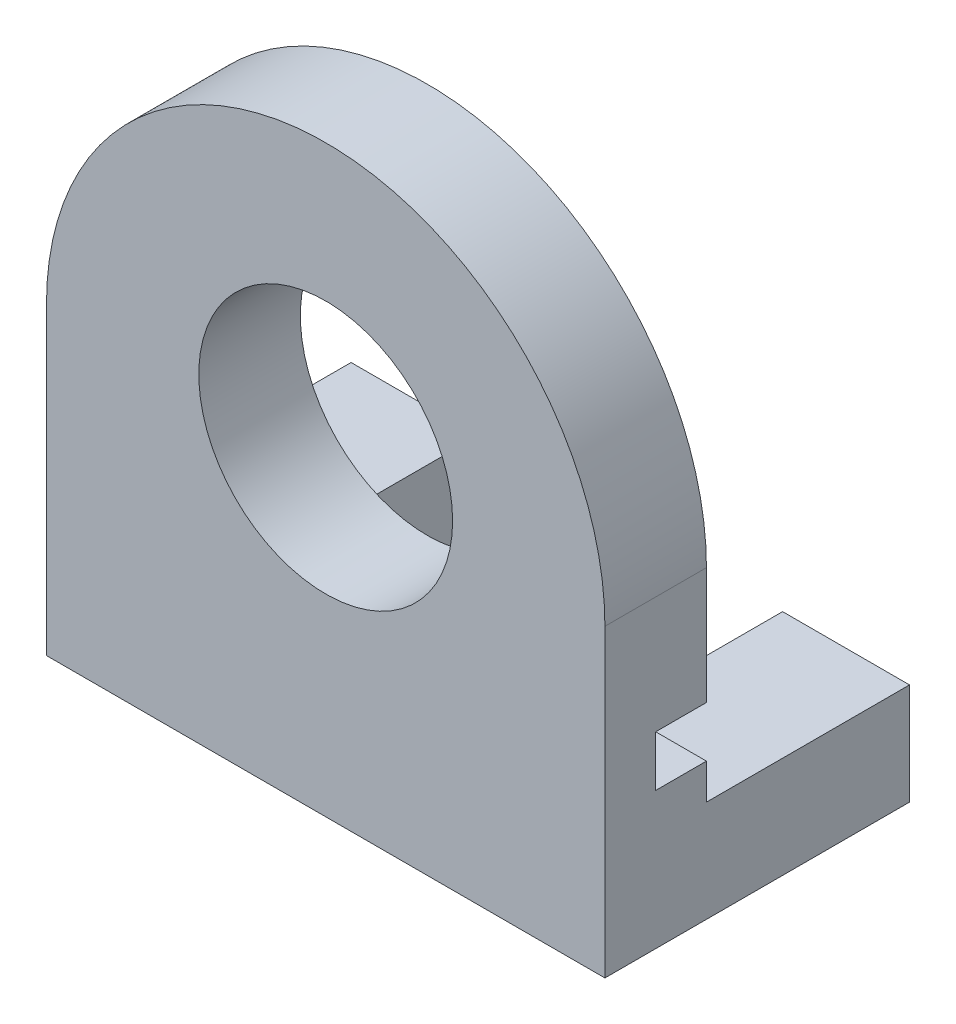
ISO-10303-21;
HEADER;
FILE_DESCRIPTION(('STEP AP214'),'2;1');
FILE_NAME('part.step','',(''),(''),'','','');
FILE_SCHEMA(('AUTOMOTIVE_DESIGN { 1 0 10303 214 1 1 1 1 }'));
ENDSEC;
DATA;
#1=APPLICATION_CONTEXT('core data for automotive mechanical design processes');
#2=APPLICATION_PROTOCOL_DEFINITION('international standard','automotive_design',2000,#1);
#3=PRODUCT_CONTEXT('',#1,'mechanical');
#4=PRODUCT('Part','Part','',(#3));
#5=PRODUCT_RELATED_PRODUCT_CATEGORY('part','',(#4));
#6=PRODUCT_DEFINITION_FORMATION('','',#4);
#7=PRODUCT_DEFINITION_CONTEXT('part definition',#1,'design');
#8=PRODUCT_DEFINITION('design','',#6,#7);
#9=PRODUCT_DEFINITION_SHAPE('','',#8);
#10=(LENGTH_UNIT() NAMED_UNIT(*) SI_UNIT(.MILLI.,.METRE.));
#11=(NAMED_UNIT(*) PLANE_ANGLE_UNIT() SI_UNIT($,.RADIAN.));
#12=(NAMED_UNIT(*) SI_UNIT($,.STERADIAN.) SOLID_ANGLE_UNIT());
#13=UNCERTAINTY_MEASURE_WITH_UNIT(LENGTH_MEASURE(1.E-05),#10,'distance_accuracy_value','');
#14=(GEOMETRIC_REPRESENTATION_CONTEXT(3) GLOBAL_UNCERTAINTY_ASSIGNED_CONTEXT((#13)) GLOBAL_UNIT_ASSIGNED_CONTEXT((#10,
#11,#12)) REPRESENTATION_CONTEXT('',''));
#15=CARTESIAN_POINT('',(0.,0.,0.));
#16=DIRECTION('',(0.,0.,1.));
#17=DIRECTION('',(1.,0.,0.));
#18=AXIS2_PLACEMENT_3D('',#15,#16,#17);
#19=CARTESIAN_POINT('',(5.5,6.,-2.));
#20=DIRECTION('',(0.,0.,1.));
#21=DIRECTION('',(1.,0.,0.));
#22=AXIS2_PLACEMENT_3D('',#19,#20,#21);
#23=PLANE('',#22);
#24=CARTESIAN_POINT('',(5.5,6.3,-2.));
#25=DIRECTION('',(0.,0.,1.));
#26=DIRECTION('',(1.,0.,0.));
#27=AXIS2_PLACEMENT_3D('',#24,#25,#26);
#28=CIRCLE('',#27,2.5);
#29=CARTESIAN_POINT('',(8.,6.3,-2.));
#30=VERTEX_POINT('',#29);
#31=EDGE_CURVE('E254',#30,#30,#28,.T.);
#32=ORIENTED_EDGE('',*,*,#31,.T.);
#33=EDGE_LOOP('',(#32));
#34=FACE_BOUND('',#33,.T.);
#35=DIRECTION('',(0.,1.,0.));
#36=VECTOR('',#35,1.);
#37=CARTESIAN_POINT('',(11.,0.,-2.));
#38=LINE('',#37,#36);
#39=CARTESIAN_POINT('',(11.,3.7,-2.));
#40=VERTEX_POINT('',#39);
#41=CARTESIAN_POINT('',(11.,6.,-2.));
#42=VERTEX_POINT('',#41);
#43=EDGE_CURVE('E180',#40,#42,#38,.T.);
#44=ORIENTED_EDGE('',*,*,#43,.F.);
#45=DIRECTION('',(-1.,0.,0.));
#46=VECTOR('',#45,1.);
#47=CARTESIAN_POINT('',(11.5,3.7,-2.));
#48=LINE('',#47,#46);
#49=CARTESIAN_POINT('',(0.,3.7,-2.));
#50=VERTEX_POINT('',#49);
#51=EDGE_CURVE('E315',#40,#50,#48,.T.);
#52=ORIENTED_EDGE('',*,*,#51,.T.);
#53=DIRECTION('',(0.,-1.,0.));
#54=VECTOR('',#53,1.);
#55=CARTESIAN_POINT('',(0.,0.,-2.));
#56=LINE('',#55,#54);
#57=CARTESIAN_POINT('',(0.,6.,-2.));
#58=VERTEX_POINT('',#57);
#59=EDGE_CURVE('E156',#58,#50,#56,.T.);
#60=ORIENTED_EDGE('',*,*,#59,.F.);
#61=CARTESIAN_POINT('',(5.5,6.,-2.));
#62=DIRECTION('',(0.,0.,1.));
#63=DIRECTION('',(1.,0.,0.));
#64=AXIS2_PLACEMENT_3D('',#61,#62,#63);
#65=CIRCLE('',#64,5.5);
#66=EDGE_CURVE('E240',#42,#58,#65,.T.);
#67=ORIENTED_EDGE('',*,*,#66,.F.);
#68=EDGE_LOOP('',(#44,#52,#60,#67));
#69=FACE_BOUND('',#68,.T.);
#70=ADVANCED_FACE('F32',(#34,#69),#23,.F.);
#71=CARTESIAN_POINT('',(0.,2.7,-2.));
#72=VERTEX_POINT('',#71);
#73=CARTESIAN_POINT('',(0.,2.,-2.));
#74=VERTEX_POINT('',#73);
#75=EDGE_CURVE('E36',#72,#74,#56,.T.);
#76=ORIENTED_EDGE('',*,*,#75,.F.);
#77=DIRECTION('',(-1.,0.,0.));
#78=VECTOR('',#77,1.);
#79=CARTESIAN_POINT('',(11.5,2.7,-2.));
#80=LINE('',#79,#78);
#81=CARTESIAN_POINT('',(11.,2.7,-2.));
#82=VERTEX_POINT('',#81);
#83=EDGE_CURVE('E133',#82,#72,#80,.T.);
#84=ORIENTED_EDGE('',*,*,#83,.F.);
#85=CARTESIAN_POINT('',(11.,2.,-2.));
#86=VERTEX_POINT('',#85);
#87=EDGE_CURVE('E241',#86,#82,#38,.T.);
#88=ORIENTED_EDGE('',*,*,#87,.F.);
#89=DIRECTION('',(1.,0.,0.));
#90=VECTOR('',#89,1.);
#91=CARTESIAN_POINT('',(11.,2.,-2.));
#92=LINE('',#91,#90);
#93=CARTESIAN_POINT('',(8.5,2.,-2.));
#94=VERTEX_POINT('',#93);
#95=EDGE_CURVE('E247',#94,#86,#92,.T.);
#96=ORIENTED_EDGE('',*,*,#95,.F.);
#97=DIRECTION('',(0.,1.,0.));
#98=VECTOR('',#97,1.);
#99=CARTESIAN_POINT('',(8.5,2.,-2.));
#100=LINE('',#99,#98);
#101=CARTESIAN_POINT('',(8.5,0.,-2.));
#102=VERTEX_POINT('',#101);
#103=EDGE_CURVE('E248',#102,#94,#100,.T.);
#104=ORIENTED_EDGE('',*,*,#103,.F.);
#105=DIRECTION('',(1.,0.,0.));
#106=VECTOR('',#105,1.);
#107=CARTESIAN_POINT('',(0.,0.,-2.));
#108=LINE('',#107,#106);
#109=CARTESIAN_POINT('',(2.5,0.,-2.));
#110=VERTEX_POINT('',#109);
#111=EDGE_CURVE('E57',#110,#102,#108,.T.);
#112=ORIENTED_EDGE('',*,*,#111,.F.);
#113=DIRECTION('',(0.,-1.,0.));
#114=VECTOR('',#113,1.);
#115=CARTESIAN_POINT('',(2.5,2.,-2.));
#116=LINE('',#115,#114);
#117=CARTESIAN_POINT('',(2.5,2.,-2.));
#118=VERTEX_POINT('',#117);
#119=EDGE_CURVE('E182',#118,#110,#116,.T.);
#120=ORIENTED_EDGE('',*,*,#119,.F.);
#121=DIRECTION('',(1.,0.,0.));
#122=VECTOR('',#121,1.);
#123=CARTESIAN_POINT('',(0.,2.,-2.));
#124=LINE('',#123,#122);
#125=EDGE_CURVE('E154',#74,#118,#124,.T.);
#126=ORIENTED_EDGE('',*,*,#125,.F.);
#127=EDGE_LOOP('',(#76,#84,#88,#96,#104,#112,#120,#126));
#128=FACE_BOUND('',#127,.T.);
#129=ADVANCED_FACE('F152',(#128),#23,.F.);
#130=CARTESIAN_POINT('',(0.,0.,-2.));
#131=DIRECTION('',(-1.,0.,0.));
#132=DIRECTION('',(0.,0.,1.));
#133=AXIS2_PLACEMENT_3D('',#130,#131,#132);
#134=PLANE('',#133);
#135=DIRECTION('',(0.,0.,-1.));
#136=VECTOR('',#135,1.);
#137=CARTESIAN_POINT('',(0.,3.7,-1.));
#138=LINE('',#137,#136);
#139=CARTESIAN_POINT('',(0.,3.7,-1.));
#140=VERTEX_POINT('',#139);
#141=EDGE_CURVE('E143',#140,#50,#138,.T.);
#142=ORIENTED_EDGE('',*,*,#141,.F.);
#143=DIRECTION('',(0.,1.,0.));
#144=VECTOR('',#143,1.);
#145=CARTESIAN_POINT('',(0.,2.7,-1.));
#146=LINE('',#145,#144);
#147=CARTESIAN_POINT('',(0.,2.7,-1.));
#148=VERTEX_POINT('',#147);
#149=EDGE_CURVE('E150',#148,#140,#146,.T.);
#150=ORIENTED_EDGE('',*,*,#149,.F.);
#151=DIRECTION('',(0.,0.,1.));
#152=VECTOR('',#151,1.);
#153=CARTESIAN_POINT('',(0.,2.7,-2.));
#154=LINE('',#153,#152);
#155=EDGE_CURVE('E136',#72,#148,#154,.T.);
#156=ORIENTED_EDGE('',*,*,#155,.F.);
#157=ORIENTED_EDGE('',*,*,#75,.T.);
#158=DIRECTION('',(0.,0.,1.));
#159=VECTOR('',#158,1.);
#160=CARTESIAN_POINT('',(0.,2.,-6.));
#161=LINE('',#160,#159);
#162=CARTESIAN_POINT('',(0.,2.,-6.));
#163=VERTEX_POINT('',#162);
#164=EDGE_CURVE('E186',#163,#74,#161,.T.);
#165=ORIENTED_EDGE('',*,*,#164,.F.);
#166=DIRECTION('',(0.,1.,0.));
#167=VECTOR('',#166,1.);
#168=CARTESIAN_POINT('',(0.,0.,-6.));
#169=LINE('',#168,#167);
#170=CARTESIAN_POINT('',(0.,0.,-6.));
#171=VERTEX_POINT('',#170);
#172=EDGE_CURVE('E203',#171,#163,#169,.T.);
#173=ORIENTED_EDGE('',*,*,#172,.F.);
#174=DIRECTION('',(0.,0.,1.));
#175=VECTOR('',#174,1.);
#176=CARTESIAN_POINT('',(0.,0.,-2.));
#177=LINE('',#176,#175);
#178=CARTESIAN_POINT('',(0.,0.,0.));
#179=VERTEX_POINT('',#178);
#180=EDGE_CURVE('E177',#171,#179,#177,.T.);
#181=ORIENTED_EDGE('',*,*,#180,.T.);
#182=DIRECTION('',(0.,-1.,0.));
#183=VECTOR('',#182,1.);
#184=CARTESIAN_POINT('',(0.,0.,0.));
#185=LINE('',#184,#183);
#186=CARTESIAN_POINT('',(0.,6.,0.));
#187=VERTEX_POINT('',#186);
#188=EDGE_CURVE('E188',#187,#179,#185,.T.);
#189=ORIENTED_EDGE('',*,*,#188,.F.);
#190=DIRECTION('',(0.,0.,1.));
#191=VECTOR('',#190,1.);
#192=CARTESIAN_POINT('',(0.,6.,-2.));
#193=LINE('',#192,#191);
#194=EDGE_CURVE('E236',#58,#187,#193,.T.);
#195=ORIENTED_EDGE('',*,*,#194,.F.);
#196=ORIENTED_EDGE('',*,*,#59,.T.);
#197=EDGE_LOOP('',(#142,#150,#156,#157,#165,#173,#181,#189,#195,#196));
#198=FACE_BOUND('',#197,.T.);
#199=ADVANCED_FACE('F34',(#198),#134,.T.);
#200=CARTESIAN_POINT('',(5.5,6.,-2.));
#201=DIRECTION('',(0.,0.,1.));
#202=DIRECTION('',(1.,0.,0.));
#203=AXIS2_PLACEMENT_3D('',#200,#201,#202);
#204=CYLINDRICAL_SURFACE('',#203,5.5);
#205=CARTESIAN_POINT('',(5.5,6.,0.));
#206=DIRECTION('',(0.,0.,1.));
#207=DIRECTION('',(1.,0.,0.));
#208=AXIS2_PLACEMENT_3D('',#205,#206,#207);
#209=CIRCLE('',#208,5.5);
#210=CARTESIAN_POINT('',(11.,6.,0.));
#211=VERTEX_POINT('',#210);
#212=EDGE_CURVE('E157',#211,#187,#209,.T.);
#213=ORIENTED_EDGE('',*,*,#212,.F.);
#214=DIRECTION('',(0.,0.,1.));
#215=VECTOR('',#214,1.);
#216=CARTESIAN_POINT('',(11.,6.,-2.));
#217=LINE('',#216,#215);
#218=EDGE_CURVE('E228',#42,#211,#217,.T.);
#219=ORIENTED_EDGE('',*,*,#218,.F.);
#220=ORIENTED_EDGE('',*,*,#66,.T.);
#221=ORIENTED_EDGE('',*,*,#194,.T.);
#222=EDGE_LOOP('',(#213,#219,#220,#221));
#223=FACE_BOUND('',#222,.T.);
#224=ADVANCED_FACE('F299',(#223),#204,.T.);
#225=CARTESIAN_POINT('',(11.,0.,-2.));
#226=DIRECTION('',(1.,0.,0.));
#227=DIRECTION('',(0.,0.,-1.));
#228=AXIS2_PLACEMENT_3D('',#225,#226,#227);
#229=PLANE('',#228);
#230=DIRECTION('',(0.,0.,1.));
#231=VECTOR('',#230,1.);
#232=CARTESIAN_POINT('',(11.,3.7,-2.));
#233=LINE('',#232,#231);
#234=CARTESIAN_POINT('',(11.,3.7,-1.));
#235=VERTEX_POINT('',#234);
#236=EDGE_CURVE('E11',#40,#235,#233,.T.);
#237=ORIENTED_EDGE('',*,*,#236,.F.);
#238=ORIENTED_EDGE('',*,*,#43,.T.);
#239=ORIENTED_EDGE('',*,*,#218,.T.);
#240=DIRECTION('',(0.,1.,0.));
#241=VECTOR('',#240,1.);
#242=CARTESIAN_POINT('',(11.,0.,0.));
#243=LINE('',#242,#241);
#244=CARTESIAN_POINT('',(11.,0.,0.));
#245=VERTEX_POINT('',#244);
#246=EDGE_CURVE('E161',#245,#211,#243,.T.);
#247=ORIENTED_EDGE('',*,*,#246,.F.);
#248=DIRECTION('',(0.,0.,1.));
#249=VECTOR('',#248,1.);
#250=CARTESIAN_POINT('',(11.,0.,-2.));
#251=LINE('',#250,#249);
#252=CARTESIAN_POINT('',(11.,0.,-6.));
#253=VERTEX_POINT('',#252);
#254=EDGE_CURVE('E221',#253,#245,#251,.T.);
#255=ORIENTED_EDGE('',*,*,#254,.F.);
#256=DIRECTION('',(0.,-1.,0.));
#257=VECTOR('',#256,1.);
#258=CARTESIAN_POINT('',(11.,0.,-6.));
#259=LINE('',#258,#257);
#260=CARTESIAN_POINT('',(11.,2.,-6.));
#261=VERTEX_POINT('',#260);
#262=EDGE_CURVE('E261',#261,#253,#259,.T.);
#263=ORIENTED_EDGE('',*,*,#262,.F.);
#264=DIRECTION('',(0.,0.,1.));
#265=VECTOR('',#264,1.);
#266=CARTESIAN_POINT('',(11.,2.,-6.));
#267=LINE('',#266,#265);
#268=EDGE_CURVE('E245',#261,#86,#267,.T.);
#269=ORIENTED_EDGE('',*,*,#268,.T.);
#270=ORIENTED_EDGE('',*,*,#87,.T.);
#271=DIRECTION('',(0.,0.,-1.));
#272=VECTOR('',#271,1.);
#273=CARTESIAN_POINT('',(11.,2.7,-2.));
#274=LINE('',#273,#272);
#275=CARTESIAN_POINT('',(11.,2.7,-1.));
#276=VERTEX_POINT('',#275);
#277=EDGE_CURVE('E139',#276,#82,#274,.T.);
#278=ORIENTED_EDGE('',*,*,#277,.F.);
#279=DIRECTION('',(0.,-1.,0.));
#280=VECTOR('',#279,1.);
#281=CARTESIAN_POINT('',(11.,0.,-1.));
#282=LINE('',#281,#280);
#283=EDGE_CURVE('E42',#235,#276,#282,.T.);
#284=ORIENTED_EDGE('',*,*,#283,.F.);
#285=EDGE_LOOP('',(#237,#238,#239,#247,#255,#263,#269,#270,#278,#284));
#286=FACE_BOUND('',#285,.T.);
#287=ADVANCED_FACE('F230',(#286),#229,.T.);
#288=CARTESIAN_POINT('',(0.,0.,-2.));
#289=DIRECTION('',(0.,-1.,0.));
#290=DIRECTION('',(0.,0.,-1.));
#291=AXIS2_PLACEMENT_3D('',#288,#289,#290);
#292=PLANE('',#291);
#293=DIRECTION('',(1.,0.,0.));
#294=VECTOR('',#293,1.);
#295=CARTESIAN_POINT('',(0.,0.,0.));
#296=LINE('',#295,#294);
#297=EDGE_CURVE('E167',#179,#245,#296,.T.);
#298=ORIENTED_EDGE('',*,*,#297,.F.);
#299=ORIENTED_EDGE('',*,*,#180,.F.);
#300=DIRECTION('',(-1.,0.,0.));
#301=VECTOR('',#300,1.);
#302=CARTESIAN_POINT('',(2.5,0.,-6.));
#303=LINE('',#302,#301);
#304=CARTESIAN_POINT('',(2.5,0.,-6.));
#305=VERTEX_POINT('',#304);
#306=EDGE_CURVE('E194',#305,#171,#303,.T.);
#307=ORIENTED_EDGE('',*,*,#306,.F.);
#308=DIRECTION('',(0.,0.,1.));
#309=VECTOR('',#308,1.);
#310=CARTESIAN_POINT('',(2.5,0.,-6.));
#311=LINE('',#310,#309);
#312=EDGE_CURVE('E195',#305,#110,#311,.T.);
#313=ORIENTED_EDGE('',*,*,#312,.T.);
#314=ORIENTED_EDGE('',*,*,#111,.T.);
#315=DIRECTION('',(0.,0.,1.));
#316=VECTOR('',#315,1.);
#317=CARTESIAN_POINT('',(8.5,0.,-6.));
#318=LINE('',#317,#316);
#319=CARTESIAN_POINT('',(8.5,0.,-6.));
#320=VERTEX_POINT('',#319);
#321=EDGE_CURVE('E183',#320,#102,#318,.T.);
#322=ORIENTED_EDGE('',*,*,#321,.F.);
#323=DIRECTION('',(-1.,0.,0.));
#324=VECTOR('',#323,1.);
#325=CARTESIAN_POINT('',(8.5,0.,-6.));
#326=LINE('',#325,#324);
#327=EDGE_CURVE('E224',#253,#320,#326,.T.);
#328=ORIENTED_EDGE('',*,*,#327,.F.);
#329=ORIENTED_EDGE('',*,*,#254,.T.);
#330=EDGE_LOOP('',(#298,#299,#307,#313,#314,#322,#328,#329));
#331=FACE_BOUND('',#330,.T.);
#332=ADVANCED_FACE('F217',(#331),#292,.T.);
#333=CARTESIAN_POINT('',(5.5,6.,0.));
#334=DIRECTION('',(0.,0.,1.));
#335=DIRECTION('',(1.,0.,0.));
#336=AXIS2_PLACEMENT_3D('',#333,#334,#335);
#337=PLANE('',#336);
#338=CARTESIAN_POINT('',(5.5,6.3,0.));
#339=DIRECTION('',(0.,0.,1.));
#340=DIRECTION('',(1.,0.,0.));
#341=AXIS2_PLACEMENT_3D('',#338,#339,#340);
#342=CIRCLE('',#341,2.5);
#343=CARTESIAN_POINT('',(8.,6.3,0.));
#344=VERTEX_POINT('',#343);
#345=EDGE_CURVE('E313',#344,#344,#342,.T.);
#346=ORIENTED_EDGE('',*,*,#345,.F.);
#347=EDGE_LOOP('',(#346));
#348=FACE_BOUND('',#347,.T.);
#349=ORIENTED_EDGE('',*,*,#188,.T.);
#350=ORIENTED_EDGE('',*,*,#297,.T.);
#351=ORIENTED_EDGE('',*,*,#246,.T.);
#352=ORIENTED_EDGE('',*,*,#212,.T.);
#353=EDGE_LOOP('',(#349,#350,#351,#352));
#354=FACE_BOUND('',#353,.T.);
#355=ADVANCED_FACE('F213',(#348,#354),#337,.T.);
#356=CARTESIAN_POINT('',(0.,2.,-6.));
#357=DIRECTION('',(0.,-1.,0.));
#358=DIRECTION('',(1.,0.,0.));
#359=AXIS2_PLACEMENT_3D('',#356,#357,#358);
#360=PLANE('',#359);
#361=ORIENTED_EDGE('',*,*,#125,.T.);
#362=DIRECTION('',(0.,0.,1.));
#363=VECTOR('',#362,1.);
#364=CARTESIAN_POINT('',(2.5,2.,-6.));
#365=LINE('',#364,#363);
#366=CARTESIAN_POINT('',(2.5,2.,-6.));
#367=VERTEX_POINT('',#366);
#368=EDGE_CURVE('E189',#367,#118,#365,.T.);
#369=ORIENTED_EDGE('',*,*,#368,.F.);
#370=DIRECTION('',(1.,0.,0.));
#371=VECTOR('',#370,1.);
#372=CARTESIAN_POINT('',(0.,2.,-6.));
#373=LINE('',#372,#371);
#374=EDGE_CURVE('E205',#163,#367,#373,.T.);
#375=ORIENTED_EDGE('',*,*,#374,.F.);
#376=ORIENTED_EDGE('',*,*,#164,.T.);
#377=EDGE_LOOP('',(#361,#369,#375,#376));
#378=FACE_BOUND('',#377,.T.);
#379=ADVANCED_FACE('F275',(#378),#360,.F.);
#380=CARTESIAN_POINT('',(2.5,2.,-6.));
#381=DIRECTION('',(-1.,0.,0.));
#382=DIRECTION('',(0.,-1.,0.));
#383=AXIS2_PLACEMENT_3D('',#380,#381,#382);
#384=PLANE('',#383);
#385=ORIENTED_EDGE('',*,*,#119,.T.);
#386=ORIENTED_EDGE('',*,*,#312,.F.);
#387=DIRECTION('',(0.,-1.,0.));
#388=VECTOR('',#387,1.);
#389=CARTESIAN_POINT('',(2.5,2.,-6.));
#390=LINE('',#389,#388);
#391=EDGE_CURVE('E207',#367,#305,#390,.T.);
#392=ORIENTED_EDGE('',*,*,#391,.F.);
#393=ORIENTED_EDGE('',*,*,#368,.T.);
#394=EDGE_LOOP('',(#385,#386,#392,#393));
#395=FACE_BOUND('',#394,.T.);
#396=ADVANCED_FACE('F272',(#395),#384,.F.);
#397=CARTESIAN_POINT('',(0.,0.,-6.));
#398=DIRECTION('',(0.,0.,-1.));
#399=DIRECTION('',(-1.,0.,0.));
#400=AXIS2_PLACEMENT_3D('',#397,#398,#399);
#401=PLANE('',#400);
#402=ORIENTED_EDGE('',*,*,#306,.T.);
#403=ORIENTED_EDGE('',*,*,#172,.T.);
#404=ORIENTED_EDGE('',*,*,#374,.T.);
#405=ORIENTED_EDGE('',*,*,#391,.T.);
#406=EDGE_LOOP('',(#402,#403,#404,#405));
#407=FACE_BOUND('',#406,.T.);
#408=ADVANCED_FACE('F278',(#407),#401,.T.);
#409=CARTESIAN_POINT('',(8.5,2.,-6.));
#410=DIRECTION('',(1.,0.,0.));
#411=DIRECTION('',(0.,1.,0.));
#412=AXIS2_PLACEMENT_3D('',#409,#410,#411);
#413=PLANE('',#412);
#414=ORIENTED_EDGE('',*,*,#103,.T.);
#415=DIRECTION('',(0.,0.,1.));
#416=VECTOR('',#415,1.);
#417=CARTESIAN_POINT('',(8.5,2.,-6.));
#418=LINE('',#417,#416);
#419=CARTESIAN_POINT('',(8.5,2.,-6.));
#420=VERTEX_POINT('',#419);
#421=EDGE_CURVE('E263',#420,#94,#418,.T.);
#422=ORIENTED_EDGE('',*,*,#421,.F.);
#423=DIRECTION('',(0.,1.,0.));
#424=VECTOR('',#423,1.);
#425=CARTESIAN_POINT('',(8.5,2.,-6.));
#426=LINE('',#425,#424);
#427=EDGE_CURVE('E252',#320,#420,#426,.T.);
#428=ORIENTED_EDGE('',*,*,#427,.F.);
#429=ORIENTED_EDGE('',*,*,#321,.T.);
#430=EDGE_LOOP('',(#414,#422,#428,#429));
#431=FACE_BOUND('',#430,.T.);
#432=ADVANCED_FACE('F267',(#431),#413,.F.);
#433=CARTESIAN_POINT('',(11.,2.,-6.));
#434=DIRECTION('',(0.,-1.,0.));
#435=DIRECTION('',(0.,0.,-1.));
#436=AXIS2_PLACEMENT_3D('',#433,#434,#435);
#437=PLANE('',#436);
#438=ORIENTED_EDGE('',*,*,#95,.T.);
#439=ORIENTED_EDGE('',*,*,#268,.F.);
#440=DIRECTION('',(1.,0.,0.));
#441=VECTOR('',#440,1.);
#442=CARTESIAN_POINT('',(11.,2.,-6.));
#443=LINE('',#442,#441);
#444=EDGE_CURVE('E259',#420,#261,#443,.T.);
#445=ORIENTED_EDGE('',*,*,#444,.F.);
#446=ORIENTED_EDGE('',*,*,#421,.T.);
#447=EDGE_LOOP('',(#438,#439,#445,#446));
#448=FACE_BOUND('',#447,.T.);
#449=ADVANCED_FACE('F285',(#448),#437,.F.);
#450=CARTESIAN_POINT('',(11.,0.,-6.));
#451=DIRECTION('',(0.,0.,1.));
#452=DIRECTION('',(1.,0.,0.));
#453=AXIS2_PLACEMENT_3D('',#450,#451,#452);
#454=PLANE('',#453);
#455=ORIENTED_EDGE('',*,*,#327,.T.);
#456=ORIENTED_EDGE('',*,*,#427,.T.);
#457=ORIENTED_EDGE('',*,*,#444,.T.);
#458=ORIENTED_EDGE('',*,*,#262,.T.);
#459=EDGE_LOOP('',(#455,#456,#457,#458));
#460=FACE_BOUND('',#459,.T.);
#461=ADVANCED_FACE('F341',(#460),#454,.F.);
#462=CARTESIAN_POINT('',(5.5,6.3,-2.));
#463=DIRECTION('',(0.,0.,1.));
#464=DIRECTION('',(1.,0.,0.));
#465=AXIS2_PLACEMENT_3D('',#462,#463,#464);
#466=CYLINDRICAL_SURFACE('',#465,2.5);
#467=ORIENTED_EDGE('',*,*,#31,.F.);
#468=EDGE_LOOP('',(#467));
#469=FACE_BOUND('',#468,.T.);
#470=ORIENTED_EDGE('',*,*,#345,.T.);
#471=EDGE_LOOP('',(#470));
#472=FACE_BOUND('',#471,.T.);
#473=ADVANCED_FACE('F334',(#469,#472),#466,.F.);
#474=CARTESIAN_POINT('',(11.5,3.7,-1.));
#475=DIRECTION('',(0.,1.,0.));
#476=DIRECTION('',(0.,0.,1.));
#477=AXIS2_PLACEMENT_3D('',#474,#475,#476);
#478=PLANE('',#477);
#479=ORIENTED_EDGE('',*,*,#236,.T.);
#480=DIRECTION('',(-1.,0.,0.));
#481=VECTOR('',#480,1.);
#482=CARTESIAN_POINT('',(11.5,3.7,-1.));
#483=LINE('',#482,#481);
#484=EDGE_CURVE('E318',#235,#140,#483,.T.);
#485=ORIENTED_EDGE('',*,*,#484,.T.);
#486=ORIENTED_EDGE('',*,*,#141,.T.);
#487=ORIENTED_EDGE('',*,*,#51,.F.);
#488=EDGE_LOOP('',(#479,#485,#486,#487));
#489=FACE_BOUND('',#488,.T.);
#490=ADVANCED_FACE('F329',(#489),#478,.F.);
#491=CARTESIAN_POINT('',(11.5,2.7,-1.));
#492=DIRECTION('',(0.,0.,1.));
#493=DIRECTION('',(1.,0.,0.));
#494=AXIS2_PLACEMENT_3D('',#491,#492,#493);
#495=PLANE('',#494);
#496=ORIENTED_EDGE('',*,*,#283,.T.);
#497=DIRECTION('',(-1.,0.,0.));
#498=VECTOR('',#497,1.);
#499=CARTESIAN_POINT('',(11.5,2.7,-1.));
#500=LINE('',#499,#498);
#501=EDGE_CURVE('E49',#276,#148,#500,.T.);
#502=ORIENTED_EDGE('',*,*,#501,.T.);
#503=ORIENTED_EDGE('',*,*,#149,.T.);
#504=ORIENTED_EDGE('',*,*,#484,.F.);
#505=EDGE_LOOP('',(#496,#502,#503,#504));
#506=FACE_BOUND('',#505,.T.);
#507=ADVANCED_FACE('F326',(#506),#495,.F.);
#508=CARTESIAN_POINT('',(11.5,2.7,-2.));
#509=DIRECTION('',(0.,-1.,0.));
#510=DIRECTION('',(0.,0.,-1.));
#511=AXIS2_PLACEMENT_3D('',#508,#509,#510);
#512=PLANE('',#511);
#513=ORIENTED_EDGE('',*,*,#277,.T.);
#514=ORIENTED_EDGE('',*,*,#83,.T.);
#515=ORIENTED_EDGE('',*,*,#155,.T.);
#516=ORIENTED_EDGE('',*,*,#501,.F.);
#517=EDGE_LOOP('',(#513,#514,#515,#516));
#518=FACE_BOUND('',#517,.T.);
#519=ADVANCED_FACE('F135',(#518),#512,.F.);
#520=CLOSED_SHELL('',(#70,#129,#199,#224,#287,#332,#355,#379,#396,#408,#432,#449,#461,#473,#490,
#507,#519));
#521=MANIFOLD_SOLID_BREP('B2',#520);
#522=ADVANCED_BREP_SHAPE_REPRESENTATION('',(#18,#521),#14);
#523=SHAPE_DEFINITION_REPRESENTATION(#9,#522);
ENDSEC;
END-ISO-10303-21;
